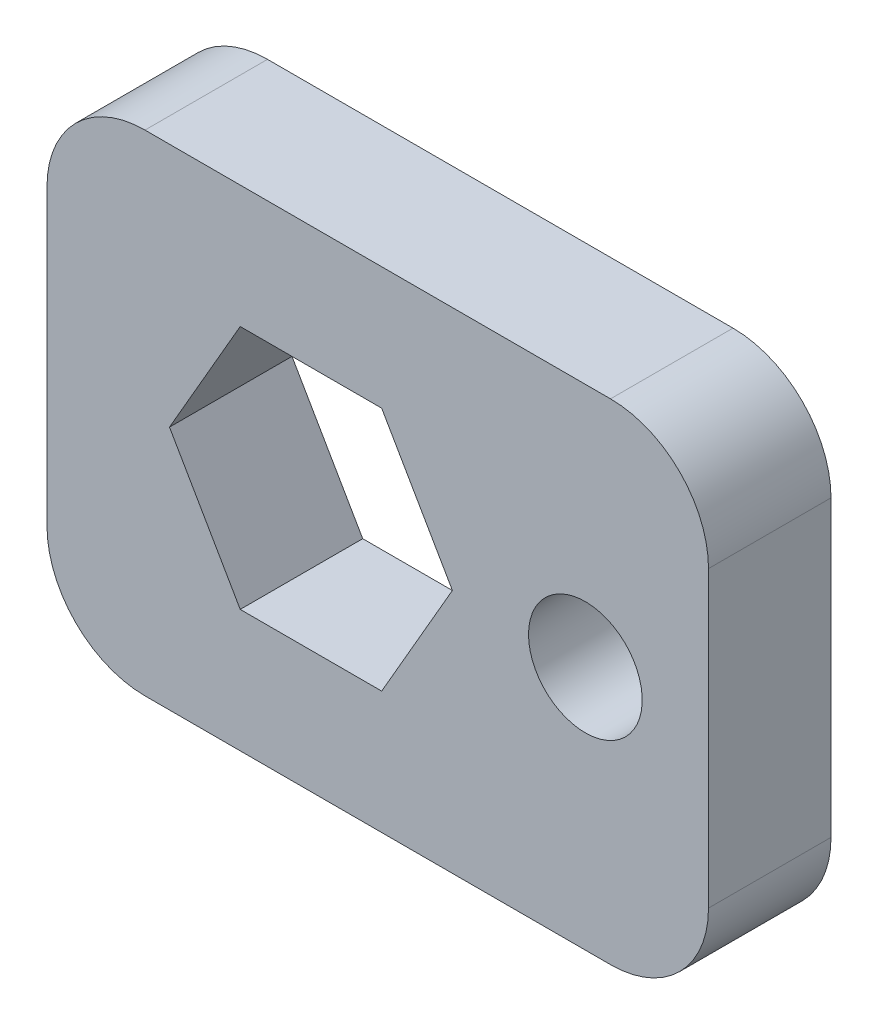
ISO-10303-21;
HEADER;
FILE_DESCRIPTION(('STEP AP214'),'2;1');
FILE_NAME('part.step','',(''),(''),'','','');
FILE_SCHEMA(('AUTOMOTIVE_DESIGN { 1 0 10303 214 1 1 1 1 }'));
ENDSEC;
DATA;
#1=APPLICATION_CONTEXT('core data for automotive mechanical design processes');
#2=APPLICATION_PROTOCOL_DEFINITION('international standard','automotive_design',2000,#1);
#3=PRODUCT_CONTEXT('',#1,'mechanical');
#4=PRODUCT('Part','Part','',(#3));
#5=PRODUCT_RELATED_PRODUCT_CATEGORY('part','',(#4));
#6=PRODUCT_DEFINITION_FORMATION('','',#4);
#7=PRODUCT_DEFINITION_CONTEXT('part definition',#1,'design');
#8=PRODUCT_DEFINITION('design','',#6,#7);
#9=PRODUCT_DEFINITION_SHAPE('','',#8);
#10=(LENGTH_UNIT() NAMED_UNIT(*) SI_UNIT(.MILLI.,.METRE.));
#11=(NAMED_UNIT(*) PLANE_ANGLE_UNIT() SI_UNIT($,.RADIAN.));
#12=(NAMED_UNIT(*) SI_UNIT($,.STERADIAN.) SOLID_ANGLE_UNIT());
#13=UNCERTAINTY_MEASURE_WITH_UNIT(LENGTH_MEASURE(1.E-05),#10,'distance_accuracy_value','');
#14=(GEOMETRIC_REPRESENTATION_CONTEXT(3) GLOBAL_UNCERTAINTY_ASSIGNED_CONTEXT((#13)) GLOBAL_UNIT_ASSIGNED_CONTEXT((#10,
#11,#12)) REPRESENTATION_CONTEXT('',''));
#15=CARTESIAN_POINT('',(0.,0.,0.));
#16=DIRECTION('',(0.,0.,1.));
#17=DIRECTION('',(1.,0.,0.));
#18=AXIS2_PLACEMENT_3D('',#15,#16,#17);
#19=CARTESIAN_POINT('',(0.,0.,-3.175));
#20=DIRECTION('',(0.,0.,1.));
#21=DIRECTION('',(1.,0.,0.));
#22=AXIS2_PLACEMENT_3D('',#19,#20,#21);
#23=PLANE('',#22);
#24=CARTESIAN_POINT('',(-3.19182579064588,6.35,-3.175));
#25=DIRECTION('',(0.,0.,-1.));
#26=DIRECTION('',(-1.,0.,0.));
#27=AXIS2_PLACEMENT_3D('',#24,#25,#26);
#28=CIRCLE('',#27,1.47319999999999);
#29=CARTESIAN_POINT('',(-4.66502579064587,6.35,-3.175));
#30=VERTEX_POINT('',#29);
#31=EDGE_CURVE('E435',#30,#30,#28,.T.);
#32=ORIENTED_EDGE('',*,*,#31,.F.);
#33=EDGE_LOOP('',(#32));
#34=FACE_BOUND('',#33,.T.);
#35=DIRECTION('',(-1.,0.,0.));
#36=VECTOR('',#35,1.);
#37=CARTESIAN_POINT('',(0.,0.,-3.175));
#38=LINE('',#37,#36);
#39=CARTESIAN_POINT('',(-2.54,0.,-3.175));
#40=VERTEX_POINT('',#39);
#41=CARTESIAN_POINT('',(-14.605,0.,-3.175));
#42=VERTEX_POINT('',#41);
#43=EDGE_CURVE('E197',#40,#42,#38,.T.);
#44=ORIENTED_EDGE('',*,*,#43,.T.);
#45=CARTESIAN_POINT('',(-14.605,2.54,-3.175));
#46=DIRECTION('',(0.,0.,1.));
#47=DIRECTION('',(1.,0.,0.));
#48=AXIS2_PLACEMENT_3D('',#45,#46,#47);
#49=CIRCLE('',#48,2.54);
#50=CARTESIAN_POINT('',(-17.145,2.54,-3.175));
#51=VERTEX_POINT('',#50);
#52=EDGE_CURVE('E237',#42,#51,#49,.F.);
#53=ORIENTED_EDGE('',*,*,#52,.T.);
#54=DIRECTION('',(0.,1.,0.));
#55=VECTOR('',#54,1.);
#56=CARTESIAN_POINT('',(-17.145,0.,-3.175));
#57=LINE('',#56,#55);
#58=CARTESIAN_POINT('',(-17.145,10.16,-3.175));
#59=VERTEX_POINT('',#58);
#60=EDGE_CURVE('E201',#51,#59,#57,.T.);
#61=ORIENTED_EDGE('',*,*,#60,.T.);
#62=CARTESIAN_POINT('',(-14.605,10.16,-3.175));
#63=DIRECTION('',(0.,0.,1.));
#64=DIRECTION('',(1.,0.,0.));
#65=AXIS2_PLACEMENT_3D('',#62,#63,#64);
#66=CIRCLE('',#65,2.54);
#67=CARTESIAN_POINT('',(-14.605,12.7,-3.175));
#68=VERTEX_POINT('',#67);
#69=EDGE_CURVE('E54',#59,#68,#66,.F.);
#70=ORIENTED_EDGE('',*,*,#69,.T.);
#71=DIRECTION('',(1.,0.,0.));
#72=VECTOR('',#71,1.);
#73=CARTESIAN_POINT('',(0.,12.7,-3.175));
#74=LINE('',#73,#72);
#75=CARTESIAN_POINT('',(-2.54,12.7,-3.175));
#76=VERTEX_POINT('',#75);
#77=EDGE_CURVE('E203',#68,#76,#74,.T.);
#78=ORIENTED_EDGE('',*,*,#77,.T.);
#79=CARTESIAN_POINT('',(-2.54,10.16,-3.175));
#80=DIRECTION('',(0.,0.,1.));
#81=DIRECTION('',(1.,0.,0.));
#82=AXIS2_PLACEMENT_3D('',#79,#80,#81);
#83=CIRCLE('',#82,2.54);
#84=CARTESIAN_POINT('',(0.,10.16,-3.175));
#85=VERTEX_POINT('',#84);
#86=EDGE_CURVE('E232',#76,#85,#83,.F.);
#87=ORIENTED_EDGE('',*,*,#86,.T.);
#88=DIRECTION('',(0.,-1.,0.));
#89=VECTOR('',#88,1.);
#90=CARTESIAN_POINT('',(0.,0.,-3.175));
#91=LINE('',#90,#89);
#92=CARTESIAN_POINT('',(0.,2.54,-3.175));
#93=VERTEX_POINT('',#92);
#94=EDGE_CURVE('E194',#85,#93,#91,.T.);
#95=ORIENTED_EDGE('',*,*,#94,.T.);
#96=CARTESIAN_POINT('',(-2.54,2.54,-3.175));
#97=DIRECTION('',(0.,0.,1.));
#98=DIRECTION('',(1.,0.,0.));
#99=AXIS2_PLACEMENT_3D('',#96,#97,#98);
#100=CIRCLE('',#99,2.54);
#101=EDGE_CURVE('E235',#93,#40,#100,.F.);
#102=ORIENTED_EDGE('',*,*,#101,.T.);
#103=EDGE_LOOP('',(#44,#53,#61,#70,#78,#87,#95,#102));
#104=FACE_BOUND('',#103,.T.);
#105=DIRECTION('',(-0.5,0.866025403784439,0.));
#106=VECTOR('',#105,1.);
#107=CARTESIAN_POINT('',(-12.1369128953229,3.175,-3.175));
#108=LINE('',#107,#106);
#109=CARTESIAN_POINT('',(-12.1369128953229,3.175,-3.175));
#110=VERTEX_POINT('',#109);
#111=CARTESIAN_POINT('',(-13.97,6.35,-3.175));
#112=VERTEX_POINT('',#111);
#113=EDGE_CURVE('E136',#110,#112,#108,.T.);
#114=ORIENTED_EDGE('',*,*,#113,.F.);
#115=DIRECTION('',(-1.,0.,0.));
#116=VECTOR('',#115,1.);
#117=CARTESIAN_POINT('',(-8.47073868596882,3.175,-3.175));
#118=LINE('',#117,#116);
#119=CARTESIAN_POINT('',(-8.47073868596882,3.175,-3.175));
#120=VERTEX_POINT('',#119);
#121=EDGE_CURVE('E169',#120,#110,#118,.T.);
#122=ORIENTED_EDGE('',*,*,#121,.F.);
#123=DIRECTION('',(-0.5,-0.866025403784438,0.));
#124=VECTOR('',#123,1.);
#125=CARTESIAN_POINT('',(-6.63765158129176,6.35,-3.175));
#126=LINE('',#125,#124);
#127=CARTESIAN_POINT('',(-6.63765158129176,6.35,-3.175));
#128=VERTEX_POINT('',#127);
#129=EDGE_CURVE('E166',#128,#120,#126,.T.);
#130=ORIENTED_EDGE('',*,*,#129,.F.);
#131=DIRECTION('',(0.5,-0.866025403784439,0.));
#132=VECTOR('',#131,1.);
#133=CARTESIAN_POINT('',(-8.47073868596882,9.525,-3.175));
#134=LINE('',#133,#132);
#135=CARTESIAN_POINT('',(-8.47073868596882,9.525,-3.175));
#136=VERTEX_POINT('',#135);
#137=EDGE_CURVE('E161',#136,#128,#134,.T.);
#138=ORIENTED_EDGE('',*,*,#137,.F.);
#139=DIRECTION('',(1.,0.,0.));
#140=VECTOR('',#139,1.);
#141=CARTESIAN_POINT('',(-12.1369128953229,9.525,-3.175));
#142=LINE('',#141,#140);
#143=CARTESIAN_POINT('',(-12.1369128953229,9.525,-3.175));
#144=VERTEX_POINT('',#143);
#145=EDGE_CURVE('E159',#144,#136,#142,.T.);
#146=ORIENTED_EDGE('',*,*,#145,.F.);
#147=DIRECTION('',(0.5,0.866025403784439,0.));
#148=VECTOR('',#147,1.);
#149=CARTESIAN_POINT('',(-13.97,6.35,-3.175));
#150=LINE('',#149,#148);
#151=EDGE_CURVE('E146',#112,#144,#150,.T.);
#152=ORIENTED_EDGE('',*,*,#151,.F.);
#153=EDGE_LOOP('',(#114,#122,#130,#138,#146,#152));
#154=FACE_BOUND('',#153,.T.);
#155=ADVANCED_FACE('F33',(#34,#104,#154),#23,.F.);
#156=CARTESIAN_POINT('',(0.,0.,0.));
#157=DIRECTION('',(0.,0.,1.));
#158=DIRECTION('',(1.,0.,0.));
#159=AXIS2_PLACEMENT_3D('',#156,#157,#158);
#160=PLANE('',#159);
#161=CARTESIAN_POINT('',(-3.19182579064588,6.35,0.));
#162=DIRECTION('',(0.,0.,-1.));
#163=DIRECTION('',(-1.,0.,0.));
#164=AXIS2_PLACEMENT_3D('',#161,#162,#163);
#165=CIRCLE('',#164,1.4732);
#166=CARTESIAN_POINT('',(-4.66502579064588,6.35,0.));
#167=VERTEX_POINT('',#166);
#168=EDGE_CURVE('E173',#167,#167,#165,.T.);
#169=ORIENTED_EDGE('',*,*,#168,.T.);
#170=EDGE_LOOP('',(#169));
#171=FACE_BOUND('',#170,.T.);
#172=DIRECTION('',(0.,1.,0.));
#173=VECTOR('',#172,1.);
#174=CARTESIAN_POINT('',(-17.145,0.,0.));
#175=LINE('',#174,#173);
#176=CARTESIAN_POINT('',(-17.145,2.54,0.));
#177=VERTEX_POINT('',#176);
#178=CARTESIAN_POINT('',(-17.145,10.16,0.));
#179=VERTEX_POINT('',#178);
#180=EDGE_CURVE('E211',#177,#179,#175,.T.);
#181=ORIENTED_EDGE('',*,*,#180,.F.);
#182=CARTESIAN_POINT('',(-14.605,2.54,0.));
#183=DIRECTION('',(0.,0.,1.));
#184=DIRECTION('',(1.,0.,0.));
#185=AXIS2_PLACEMENT_3D('',#182,#183,#184);
#186=CIRCLE('',#185,2.54);
#187=CARTESIAN_POINT('',(-14.605,0.,0.));
#188=VERTEX_POINT('',#187);
#189=EDGE_CURVE('E225',#177,#188,#186,.T.);
#190=ORIENTED_EDGE('',*,*,#189,.T.);
#191=DIRECTION('',(-1.,0.,0.));
#192=VECTOR('',#191,1.);
#193=CARTESIAN_POINT('',(0.,0.,0.));
#194=LINE('',#193,#192);
#195=CARTESIAN_POINT('',(-2.54,0.,0.));
#196=VERTEX_POINT('',#195);
#197=EDGE_CURVE('E208',#196,#188,#194,.T.);
#198=ORIENTED_EDGE('',*,*,#197,.F.);
#199=CARTESIAN_POINT('',(-2.54,2.54,0.));
#200=DIRECTION('',(0.,0.,1.));
#201=DIRECTION('',(1.,0.,0.));
#202=AXIS2_PLACEMENT_3D('',#199,#200,#201);
#203=CIRCLE('',#202,2.54);
#204=CARTESIAN_POINT('',(0.,2.54,0.));
#205=VERTEX_POINT('',#204);
#206=EDGE_CURVE('E223',#196,#205,#203,.T.);
#207=ORIENTED_EDGE('',*,*,#206,.T.);
#208=DIRECTION('',(0.,-1.,0.));
#209=VECTOR('',#208,1.);
#210=CARTESIAN_POINT('',(0.,0.,0.));
#211=LINE('',#210,#209);
#212=CARTESIAN_POINT('',(0.,10.16,0.));
#213=VERTEX_POINT('',#212);
#214=EDGE_CURVE('E154',#213,#205,#211,.T.);
#215=ORIENTED_EDGE('',*,*,#214,.F.);
#216=CARTESIAN_POINT('',(-2.54,10.16,0.));
#217=DIRECTION('',(0.,0.,1.));
#218=DIRECTION('',(1.,0.,0.));
#219=AXIS2_PLACEMENT_3D('',#216,#217,#218);
#220=CIRCLE('',#219,2.54);
#221=CARTESIAN_POINT('',(-2.54,12.7,0.));
#222=VERTEX_POINT('',#221);
#223=EDGE_CURVE('E219',#213,#222,#220,.T.);
#224=ORIENTED_EDGE('',*,*,#223,.T.);
#225=DIRECTION('',(1.,0.,0.));
#226=VECTOR('',#225,1.);
#227=CARTESIAN_POINT('',(0.,12.7,0.));
#228=LINE('',#227,#226);
#229=CARTESIAN_POINT('',(-14.605,12.7,0.));
#230=VERTEX_POINT('',#229);
#231=EDGE_CURVE('E198',#230,#222,#228,.T.);
#232=ORIENTED_EDGE('',*,*,#231,.F.);
#233=CARTESIAN_POINT('',(-14.605,10.16,0.));
#234=DIRECTION('',(0.,0.,1.));
#235=DIRECTION('',(1.,0.,0.));
#236=AXIS2_PLACEMENT_3D('',#233,#234,#235);
#237=CIRCLE('',#236,2.54);
#238=EDGE_CURVE('E221',#230,#179,#237,.T.);
#239=ORIENTED_EDGE('',*,*,#238,.T.);
#240=EDGE_LOOP('',(#181,#190,#198,#207,#215,#224,#232,#239));
#241=FACE_BOUND('',#240,.T.);
#242=DIRECTION('',(-1.,0.,0.));
#243=VECTOR('',#242,1.);
#244=CARTESIAN_POINT('',(-8.47073868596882,3.175,0.));
#245=LINE('',#244,#243);
#246=CARTESIAN_POINT('',(-8.47073868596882,3.175,0.));
#247=VERTEX_POINT('',#246);
#248=CARTESIAN_POINT('',(-12.1369128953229,3.175,0.));
#249=VERTEX_POINT('',#248);
#250=EDGE_CURVE('E147',#247,#249,#245,.T.);
#251=ORIENTED_EDGE('',*,*,#250,.T.);
#252=DIRECTION('',(-0.5,0.866025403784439,0.));
#253=VECTOR('',#252,1.);
#254=CARTESIAN_POINT('',(-12.1369128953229,3.175,0.));
#255=LINE('',#254,#253);
#256=CARTESIAN_POINT('',(-13.97,6.35,0.));
#257=VERTEX_POINT('',#256);
#258=EDGE_CURVE('E171',#249,#257,#255,.T.);
#259=ORIENTED_EDGE('',*,*,#258,.T.);
#260=DIRECTION('',(0.5,0.866025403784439,0.));
#261=VECTOR('',#260,1.);
#262=CARTESIAN_POINT('',(-13.97,6.35,0.));
#263=LINE('',#262,#261);
#264=CARTESIAN_POINT('',(-12.1369128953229,9.525,0.));
#265=VERTEX_POINT('',#264);
#266=EDGE_CURVE('E153',#257,#265,#263,.T.);
#267=ORIENTED_EDGE('',*,*,#266,.T.);
#268=DIRECTION('',(1.,0.,0.));
#269=VECTOR('',#268,1.);
#270=CARTESIAN_POINT('',(-12.1369128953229,9.525,0.));
#271=LINE('',#270,#269);
#272=CARTESIAN_POINT('',(-8.47073868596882,9.525,0.));
#273=VERTEX_POINT('',#272);
#274=EDGE_CURVE('E175',#265,#273,#271,.T.);
#275=ORIENTED_EDGE('',*,*,#274,.T.);
#276=DIRECTION('',(0.5,-0.866025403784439,0.));
#277=VECTOR('',#276,1.);
#278=CARTESIAN_POINT('',(-8.47073868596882,9.525,0.));
#279=LINE('',#278,#277);
#280=CARTESIAN_POINT('',(-6.63765158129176,6.35,0.));
#281=VERTEX_POINT('',#280);
#282=EDGE_CURVE('E178',#273,#281,#279,.T.);
#283=ORIENTED_EDGE('',*,*,#282,.T.);
#284=DIRECTION('',(-0.5,-0.866025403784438,0.));
#285=VECTOR('',#284,1.);
#286=CARTESIAN_POINT('',(-6.63765158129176,6.35,0.));
#287=LINE('',#286,#285);
#288=EDGE_CURVE('E181',#281,#247,#287,.T.);
#289=ORIENTED_EDGE('',*,*,#288,.T.);
#290=EDGE_LOOP('',(#251,#259,#267,#275,#283,#289));
#291=FACE_BOUND('',#290,.T.);
#292=ADVANCED_FACE('F261',(#171,#241,#291),#160,.T.);
#293=CARTESIAN_POINT('',(0.,0.,-3.175));
#294=DIRECTION('',(-1.,0.,0.));
#295=DIRECTION('',(0.,0.,1.));
#296=AXIS2_PLACEMENT_3D('',#293,#294,#295);
#297=PLANE('',#296);
#298=ORIENTED_EDGE('',*,*,#214,.T.);
#299=DIRECTION('',(0.,0.,1.));
#300=VECTOR('',#299,1.);
#301=CARTESIAN_POINT('',(0.,2.54,-3.175));
#302=LINE('',#301,#300);
#303=EDGE_CURVE('E242',#205,#93,#302,.F.);
#304=ORIENTED_EDGE('',*,*,#303,.T.);
#305=ORIENTED_EDGE('',*,*,#94,.F.);
#306=DIRECTION('',(0.,0.,1.));
#307=VECTOR('',#306,1.);
#308=CARTESIAN_POINT('',(0.,10.16,-3.175));
#309=LINE('',#308,#307);
#310=EDGE_CURVE('E239',#85,#213,#309,.T.);
#311=ORIENTED_EDGE('',*,*,#310,.T.);
#312=EDGE_LOOP('',(#298,#304,#305,#311));
#313=FACE_BOUND('',#312,.T.);
#314=ADVANCED_FACE('F246',(#313),#297,.F.);
#315=CARTESIAN_POINT('',(0.,0.,-3.175));
#316=DIRECTION('',(0.,1.,0.));
#317=DIRECTION('',(0.,0.,1.));
#318=AXIS2_PLACEMENT_3D('',#315,#316,#317);
#319=PLANE('',#318);
#320=ORIENTED_EDGE('',*,*,#197,.T.);
#321=DIRECTION('',(0.,0.,1.));
#322=VECTOR('',#321,1.);
#323=CARTESIAN_POINT('',(-14.605,0.,-3.175));
#324=LINE('',#323,#322);
#325=EDGE_CURVE('E230',#188,#42,#324,.F.);
#326=ORIENTED_EDGE('',*,*,#325,.T.);
#327=ORIENTED_EDGE('',*,*,#43,.F.);
#328=DIRECTION('',(0.,0.,1.));
#329=VECTOR('',#328,1.);
#330=CARTESIAN_POINT('',(-2.54,0.,-3.175));
#331=LINE('',#330,#329);
#332=EDGE_CURVE('E227',#40,#196,#331,.T.);
#333=ORIENTED_EDGE('',*,*,#332,.T.);
#334=EDGE_LOOP('',(#320,#326,#327,#333));
#335=FACE_BOUND('',#334,.T.);
#336=ADVANCED_FACE('F257',(#335),#319,.F.);
#337=CARTESIAN_POINT('',(-17.145,0.,-3.175));
#338=DIRECTION('',(1.,0.,0.));
#339=DIRECTION('',(0.,0.,-1.));
#340=AXIS2_PLACEMENT_3D('',#337,#338,#339);
#341=PLANE('',#340);
#342=ORIENTED_EDGE('',*,*,#60,.F.);
#343=DIRECTION('',(0.,0.,1.));
#344=VECTOR('',#343,1.);
#345=CARTESIAN_POINT('',(-17.145,2.54,-3.175));
#346=LINE('',#345,#344);
#347=EDGE_CURVE('E216',#51,#177,#346,.T.);
#348=ORIENTED_EDGE('',*,*,#347,.T.);
#349=ORIENTED_EDGE('',*,*,#180,.T.);
#350=DIRECTION('',(0.,0.,1.));
#351=VECTOR('',#350,1.);
#352=CARTESIAN_POINT('',(-17.145,10.16,-3.175));
#353=LINE('',#352,#351);
#354=EDGE_CURVE('E205',#179,#59,#353,.F.);
#355=ORIENTED_EDGE('',*,*,#354,.T.);
#356=EDGE_LOOP('',(#342,#348,#349,#355));
#357=FACE_BOUND('',#356,.T.);
#358=ADVANCED_FACE('F269',(#357),#341,.F.);
#359=CARTESIAN_POINT('',(0.,12.7,-3.175));
#360=DIRECTION('',(0.,-1.,0.));
#361=DIRECTION('',(0.,0.,-1.));
#362=AXIS2_PLACEMENT_3D('',#359,#360,#361);
#363=PLANE('',#362);
#364=ORIENTED_EDGE('',*,*,#77,.F.);
#365=DIRECTION('',(0.,0.,1.));
#366=VECTOR('',#365,1.);
#367=CARTESIAN_POINT('',(-14.605,12.7,-3.175));
#368=LINE('',#367,#366);
#369=EDGE_CURVE('E11',#68,#230,#368,.T.);
#370=ORIENTED_EDGE('',*,*,#369,.T.);
#371=ORIENTED_EDGE('',*,*,#231,.T.);
#372=DIRECTION('',(0.,0.,1.));
#373=VECTOR('',#372,1.);
#374=CARTESIAN_POINT('',(-2.54,12.7,-3.175));
#375=LINE('',#374,#373);
#376=EDGE_CURVE('E41',#222,#76,#375,.F.);
#377=ORIENTED_EDGE('',*,*,#376,.T.);
#378=EDGE_LOOP('',(#364,#370,#371,#377));
#379=FACE_BOUND('',#378,.T.);
#380=ADVANCED_FACE('F275',(#379),#363,.F.);
#381=CARTESIAN_POINT('',(-12.1369128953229,3.175,-3.175));
#382=DIRECTION('',(0.866025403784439,0.5,0.));
#383=DIRECTION('',(-0.5,0.866025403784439,0.));
#384=AXIS2_PLACEMENT_3D('',#381,#382,#383);
#385=PLANE('',#384);
#386=ORIENTED_EDGE('',*,*,#258,.F.);
#387=DIRECTION('',(0.,0.,1.));
#388=VECTOR('',#387,1.);
#389=CARTESIAN_POINT('',(-12.1369128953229,3.175,-3.175));
#390=LINE('',#389,#388);
#391=EDGE_CURVE('E142',#110,#249,#390,.T.);
#392=ORIENTED_EDGE('',*,*,#391,.F.);
#393=ORIENTED_EDGE('',*,*,#113,.T.);
#394=DIRECTION('',(0.,0.,1.));
#395=VECTOR('',#394,1.);
#396=CARTESIAN_POINT('',(-13.97,6.35,-3.175));
#397=LINE('',#396,#395);
#398=EDGE_CURVE('E139',#112,#257,#397,.T.);
#399=ORIENTED_EDGE('',*,*,#398,.T.);
#400=EDGE_LOOP('',(#386,#392,#393,#399));
#401=FACE_BOUND('',#400,.T.);
#402=ADVANCED_FACE('F138',(#401),#385,.T.);
#403=CARTESIAN_POINT('',(-13.97,6.35,-3.175));
#404=DIRECTION('',(0.866025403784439,-0.5,0.));
#405=DIRECTION('',(0.5,0.866025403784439,0.));
#406=AXIS2_PLACEMENT_3D('',#403,#404,#405);
#407=PLANE('',#406);
#408=ORIENTED_EDGE('',*,*,#266,.F.);
#409=ORIENTED_EDGE('',*,*,#398,.F.);
#410=ORIENTED_EDGE('',*,*,#151,.T.);
#411=DIRECTION('',(0.,0.,1.));
#412=VECTOR('',#411,1.);
#413=CARTESIAN_POINT('',(-12.1369128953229,9.525,-3.175));
#414=LINE('',#413,#412);
#415=EDGE_CURVE('E155',#144,#265,#414,.T.);
#416=ORIENTED_EDGE('',*,*,#415,.T.);
#417=EDGE_LOOP('',(#408,#409,#410,#416));
#418=FACE_BOUND('',#417,.T.);
#419=ADVANCED_FACE('F150',(#418),#407,.T.);
#420=CARTESIAN_POINT('',(-12.1369128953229,9.525,-3.175));
#421=DIRECTION('',(0.,-1.,0.));
#422=DIRECTION('',(0.,0.,-1.));
#423=AXIS2_PLACEMENT_3D('',#420,#421,#422);
#424=PLANE('',#423);
#425=ORIENTED_EDGE('',*,*,#274,.F.);
#426=ORIENTED_EDGE('',*,*,#415,.F.);
#427=ORIENTED_EDGE('',*,*,#145,.T.);
#428=DIRECTION('',(0.,0.,1.));
#429=VECTOR('',#428,1.);
#430=CARTESIAN_POINT('',(-8.47073868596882,9.525,-3.175));
#431=LINE('',#430,#429);
#432=EDGE_CURVE('E191',#136,#273,#431,.T.);
#433=ORIENTED_EDGE('',*,*,#432,.T.);
#434=EDGE_LOOP('',(#425,#426,#427,#433));
#435=FACE_BOUND('',#434,.T.);
#436=ADVANCED_FACE('F361',(#435),#424,.T.);
#437=CARTESIAN_POINT('',(-8.47073868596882,9.525,-3.175));
#438=DIRECTION('',(-0.866025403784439,-0.5,0.));
#439=DIRECTION('',(0.5,-0.866025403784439,0.));
#440=AXIS2_PLACEMENT_3D('',#437,#438,#439);
#441=PLANE('',#440);
#442=ORIENTED_EDGE('',*,*,#282,.F.);
#443=ORIENTED_EDGE('',*,*,#432,.F.);
#444=ORIENTED_EDGE('',*,*,#137,.T.);
#445=DIRECTION('',(0.,0.,1.));
#446=VECTOR('',#445,1.);
#447=CARTESIAN_POINT('',(-6.63765158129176,6.35,-3.175));
#448=LINE('',#447,#446);
#449=EDGE_CURVE('E189',#128,#281,#448,.T.);
#450=ORIENTED_EDGE('',*,*,#449,.T.);
#451=EDGE_LOOP('',(#442,#443,#444,#450));
#452=FACE_BOUND('',#451,.T.);
#453=ADVANCED_FACE('F352',(#452),#441,.T.);
#454=CARTESIAN_POINT('',(-6.63765158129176,6.35,-3.175));
#455=DIRECTION('',(-0.866025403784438,0.5,0.));
#456=DIRECTION('',(-0.5,-0.866025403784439,0.));
#457=AXIS2_PLACEMENT_3D('',#454,#455,#456);
#458=PLANE('',#457);
#459=ORIENTED_EDGE('',*,*,#288,.F.);
#460=ORIENTED_EDGE('',*,*,#449,.F.);
#461=ORIENTED_EDGE('',*,*,#129,.T.);
#462=DIRECTION('',(0.,0.,1.));
#463=VECTOR('',#462,1.);
#464=CARTESIAN_POINT('',(-8.47073868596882,3.175,-3.175));
#465=LINE('',#464,#463);
#466=EDGE_CURVE('E187',#120,#247,#465,.T.);
#467=ORIENTED_EDGE('',*,*,#466,.T.);
#468=EDGE_LOOP('',(#459,#460,#461,#467));
#469=FACE_BOUND('',#468,.T.);
#470=ADVANCED_FACE('F343',(#469),#458,.T.);
#471=CARTESIAN_POINT('',(-8.47073868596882,3.175,-3.175));
#472=DIRECTION('',(0.,1.,0.));
#473=DIRECTION('',(-1.,0.,0.));
#474=AXIS2_PLACEMENT_3D('',#471,#472,#473);
#475=PLANE('',#474);
#476=ORIENTED_EDGE('',*,*,#250,.F.);
#477=ORIENTED_EDGE('',*,*,#466,.F.);
#478=ORIENTED_EDGE('',*,*,#121,.T.);
#479=ORIENTED_EDGE('',*,*,#391,.T.);
#480=EDGE_LOOP('',(#476,#477,#478,#479));
#481=FACE_BOUND('',#480,.T.);
#482=ADVANCED_FACE('F334',(#481),#475,.T.);
#483=CARTESIAN_POINT('',(-3.19182579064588,6.35,-3.175));
#484=DIRECTION('',(0.,0.,-1.));
#485=DIRECTION('',(-1.,0.,0.));
#486=AXIS2_PLACEMENT_3D('',#483,#484,#485);
#487=CYLINDRICAL_SURFACE('',#486,1.47319999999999);
#488=ORIENTED_EDGE('',*,*,#168,.F.);
#489=EDGE_LOOP('',(#488));
#490=FACE_BOUND('',#489,.T.);
#491=ORIENTED_EDGE('',*,*,#31,.T.);
#492=EDGE_LOOP('',(#491));
#493=FACE_BOUND('',#492,.T.);
#494=ADVANCED_FACE('F303',(#490,#493),#487,.F.);
#495=CARTESIAN_POINT('',(-14.605,2.54,-3.175));
#496=DIRECTION('',(0.,0.,1.));
#497=DIRECTION('',(1.,0.,0.));
#498=AXIS2_PLACEMENT_3D('',#495,#496,#497);
#499=CYLINDRICAL_SURFACE('',#498,2.54);
#500=ORIENTED_EDGE('',*,*,#52,.F.);
#501=ORIENTED_EDGE('',*,*,#325,.F.);
#502=ORIENTED_EDGE('',*,*,#189,.F.);
#503=ORIENTED_EDGE('',*,*,#347,.F.);
#504=EDGE_LOOP('',(#500,#501,#502,#503));
#505=FACE_BOUND('',#504,.T.);
#506=ADVANCED_FACE('F266',(#505),#499,.T.);
#507=CARTESIAN_POINT('',(-2.54,2.54,-3.175));
#508=DIRECTION('',(0.,0.,1.));
#509=DIRECTION('',(1.,0.,0.));
#510=AXIS2_PLACEMENT_3D('',#507,#508,#509);
#511=CYLINDRICAL_SURFACE('',#510,2.54);
#512=ORIENTED_EDGE('',*,*,#101,.F.);
#513=ORIENTED_EDGE('',*,*,#303,.F.);
#514=ORIENTED_EDGE('',*,*,#206,.F.);
#515=ORIENTED_EDGE('',*,*,#332,.F.);
#516=EDGE_LOOP('',(#512,#513,#514,#515));
#517=FACE_BOUND('',#516,.T.);
#518=ADVANCED_FACE('F254',(#517),#511,.T.);
#519=CARTESIAN_POINT('',(-14.605,10.16,-3.175));
#520=DIRECTION('',(0.,0.,1.));
#521=DIRECTION('',(1.,0.,0.));
#522=AXIS2_PLACEMENT_3D('',#519,#520,#521);
#523=CYLINDRICAL_SURFACE('',#522,2.54);
#524=ORIENTED_EDGE('',*,*,#69,.F.);
#525=ORIENTED_EDGE('',*,*,#354,.F.);
#526=ORIENTED_EDGE('',*,*,#238,.F.);
#527=ORIENTED_EDGE('',*,*,#369,.F.);
#528=EDGE_LOOP('',(#524,#525,#526,#527));
#529=FACE_BOUND('',#528,.T.);
#530=ADVANCED_FACE('F273',(#529),#523,.T.);
#531=CARTESIAN_POINT('',(-2.54,10.16,-3.175));
#532=DIRECTION('',(0.,0.,1.));
#533=DIRECTION('',(1.,0.,0.));
#534=AXIS2_PLACEMENT_3D('',#531,#532,#533);
#535=CYLINDRICAL_SURFACE('',#534,2.54);
#536=ORIENTED_EDGE('',*,*,#86,.F.);
#537=ORIENTED_EDGE('',*,*,#376,.F.);
#538=ORIENTED_EDGE('',*,*,#223,.F.);
#539=ORIENTED_EDGE('',*,*,#310,.F.);
#540=EDGE_LOOP('',(#536,#537,#538,#539));
#541=FACE_BOUND('',#540,.T.);
#542=ADVANCED_FACE('F35',(#541),#535,.T.);
#543=CLOSED_SHELL('',(#155,#292,#314,#336,#358,#380,#402,#419,#436,#453,#470,#482,#494,#506,
#518,#530,#542));
#544=MANIFOLD_SOLID_BREP('B2',#543);
#545=ADVANCED_BREP_SHAPE_REPRESENTATION('',(#18,#544),#14);
#546=SHAPE_DEFINITION_REPRESENTATION(#9,#545);
ENDSEC;
END-ISO-10303-21;
